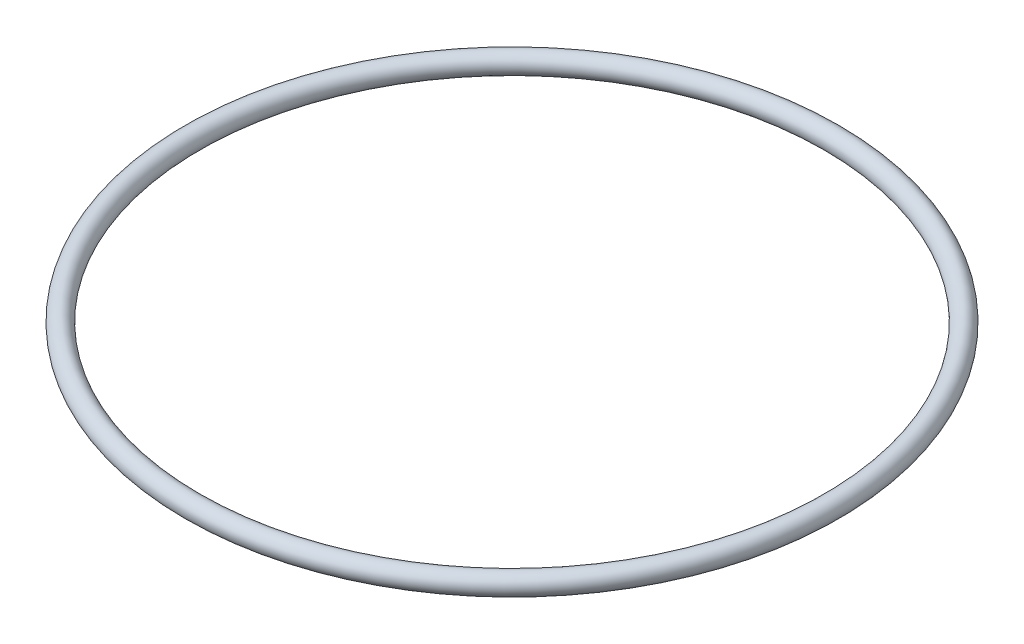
ISO-10303-21;
HEADER;
FILE_DESCRIPTION(('STEP AP214'),'2;1');
FILE_NAME('part.step','',(''),(''),'','','');
FILE_SCHEMA(('AUTOMOTIVE_DESIGN { 1 0 10303 214 1 1 1 1 }'));
ENDSEC;
DATA;
#1=APPLICATION_CONTEXT('core data for automotive mechanical design processes');
#2=APPLICATION_PROTOCOL_DEFINITION('international standard','automotive_design',2000,#1);
#3=PRODUCT_CONTEXT('',#1,'mechanical');
#4=PRODUCT('Part','Part','',(#3));
#5=PRODUCT_RELATED_PRODUCT_CATEGORY('part','',(#4));
#6=PRODUCT_DEFINITION_FORMATION('','',#4);
#7=PRODUCT_DEFINITION_CONTEXT('part definition',#1,'design');
#8=PRODUCT_DEFINITION('design','',#6,#7);
#9=PRODUCT_DEFINITION_SHAPE('','',#8);
#10=(LENGTH_UNIT() NAMED_UNIT(*) SI_UNIT(.MILLI.,.METRE.));
#11=(NAMED_UNIT(*) PLANE_ANGLE_UNIT() SI_UNIT($,.RADIAN.));
#12=(NAMED_UNIT(*) SI_UNIT($,.STERADIAN.) SOLID_ANGLE_UNIT());
#13=UNCERTAINTY_MEASURE_WITH_UNIT(LENGTH_MEASURE(1.E-05),#10,'distance_accuracy_value','');
#14=(GEOMETRIC_REPRESENTATION_CONTEXT(3) GLOBAL_UNCERTAINTY_ASSIGNED_CONTEXT((#13)) GLOBAL_UNIT_ASSIGNED_CONTEXT((#10,
#11,#12)) REPRESENTATION_CONTEXT('',''));
#15=CARTESIAN_POINT('',(0.,0.,0.));
#16=DIRECTION('',(0.,0.,1.));
#17=DIRECTION('',(1.,0.,0.));
#18=AXIS2_PLACEMENT_3D('',#15,#16,#17);
#19=CARTESIAN_POINT('',(0.,0.,0.));
#20=DIRECTION('',(0.,-1.,0.));
#21=DIRECTION('',(0.,0.,-1.));
#22=AXIS2_PLACEMENT_3D('',#19,#20,#21);
#23=TOROIDAL_SURFACE('',#22,55.5371,1.7653);
#24=CARTESIAN_POINT('',(0.,0.,-57.3024));
#25=VERTEX_POINT('',#24);
#26=VERTEX_LOOP('',#25);
#27=FACE_BOUND('',#26,.T.);
#28=ADVANCED_FACE('F30',(#27),#23,.T.);
#29=CLOSED_SHELL('',(#28));
#30=MANIFOLD_SOLID_BREP('B2',#29);
#31=ADVANCED_BREP_SHAPE_REPRESENTATION('',(#18,#30),#14);
#32=SHAPE_DEFINITION_REPRESENTATION(#9,#31);
ENDSEC;
END-ISO-10303-21;
